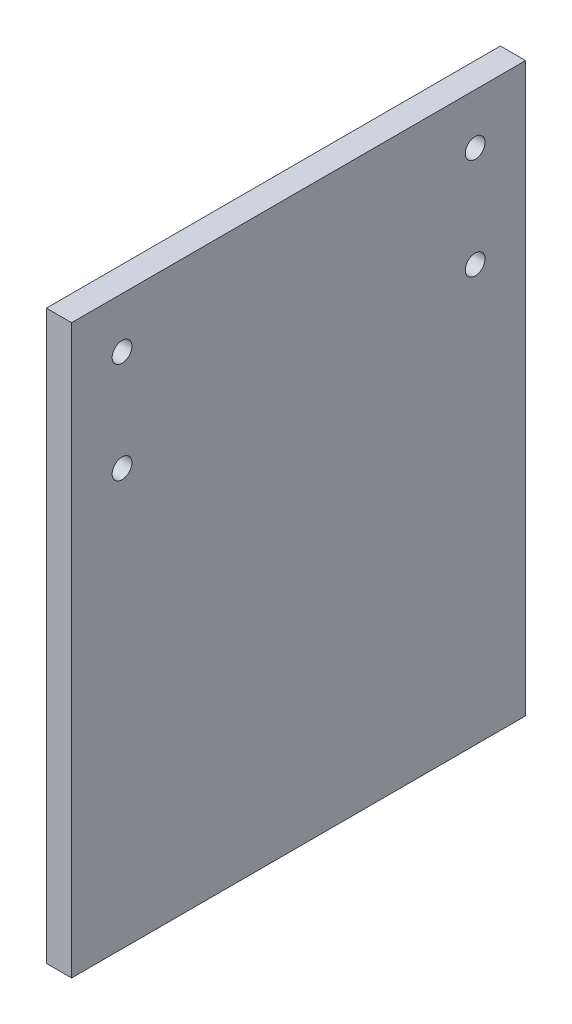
from build123d import *

# Parameters (mm, degrees)
SKETCH1_W              = 114.3
SKETCH1_H              = 142.875
BOSS_EXTRUDE1_DEPTH    = 3.175
F_10_CLEARANCE_HOLE2_D = 4.9784


with BuildPart() as part:
    # Sketch1 → Boss-Extrude1 (new, symmetric)
    with BuildSketch(Plane(origin=(0, 0, 0), x_dir=(0, 0, -1), z_dir=(1, 0, 0))):
        Rectangle(SKETCH1_W, SKETCH1_H)
    extrude(amount=BOSS_EXTRUDE1_DEPTH, both=True)

    # 10 Clearance Hole2 (through all)
    with Locations(Plane(origin=(3.175, 0, 0), x_dir=(0, 0, -1), z_dir=(1, 0, 0))):
        with Locations((-385.90023999, 88.966630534), (44.45, 58.7375), (-44.45, 58.7375), (-44.45, 33.3375), (44.45, 33.3375)):
            Hole(F_10_CLEARANCE_HOLE2_D / 2)


solid = part.part
